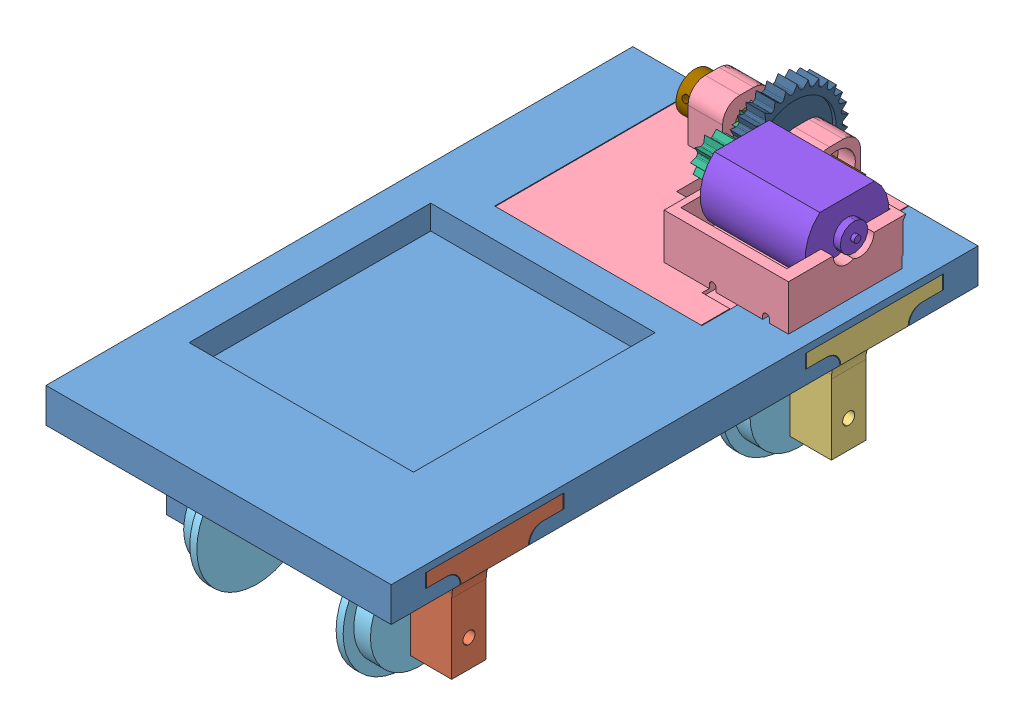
SolidWorks assembly Assem2.SLDASM, configuration 1:48 (file format 10000). Lengths in mm.
Overall size (100.76 89.97 188.72).
16 component instances, 10 part files, 34 mates.
Components (placement in the parent):
- Body-v2-1: Body-v2.SLDPRT [Default] at (-15.9866 -10.977 75.2615) size (100 40 170)
- Wheel leg-1: Wheel leg.SLDPRT [Default] at (7.0634 -20.977 130.2615) size (28.46 38 39.5)
- Wheel leg back-1: Wheel leg back.SLDPRT [Default] at (7.0634 -20.977 20.2615) size (28.46 38 39.5)
- platform-1: platform.SLDPRT [기본] at (-15.9866 -20.977 50.2615) x (-1 0 0) z (0 0 -1) size (84.5 40 60)
- Wheels-1: Wheels.SLDPRT [Default] at (5.4309 -42.977 20.2615) x (0 0 -1) z (1 0 0) size (34.75 34.75 71.1)
- Wheels-2: Wheels.SLDPRT [Default] at (5.4309 -42.977 130.2615) x (0 0 -1) z (1 0 0) size (34.75 34.75 71.1)
- 10-T-Gear-1: 10-T-Gear.SLDPRT [Default] at (-29.9291 -28.367 -0.0285) x (0 0.227115 0.973868) z (0 0.973868 -0.227115) size (10.42 5.5 10.96)
- 10-T-Gear-2: 10-T-Gear.SLDPRT [Default] at (-22.4291 -3.367 -0.0285) x (0 0.934537 -0.355867) z (0 -0.355867 -0.934537) size (10.42 5.5 10.96)
- 10-T-Gear-3: 10-T-Gear.SLDPRT [Default] at (-9.4291 2.173 19.1889) x (0 -0.761659 0.647978) z (0 -0.647978 -0.761659) size (10.42 5.5 10.96)
- 40-T-Gear-1: 40-T-Gear.SLDPRT [Default] at (-16.9291 -28.367 -0.0285) x (0 0.500653 0.865648) z (0 -0.865648 0.500653) size (41.62 5.5 41.62)
- 40-T-Gear-2: 40-T-Gear.SLDPRT [Default] at (-14.9291 -3.367 -0.0285) x (0 -0.105905 -0.994376) z (0 -0.994376 0.105905) size (41.62 5.5 41.62) (suppressed, hidden)
- 40-T-Gear-3: 40-T-Gear.SLDPRT [Default] at (-24.4291 -42.977 20.2615) x (0 -0.657601 0.753367) z (0 -0.753367 -0.657601) size (41.62 5.5 41.62)
- Motor-1: Motor.SLDPRT [Default] at (-5.4791 2.173 19.1889) x (0 0 -1) z (1 0 0) size (24.2 18.3 42)
- gear shaft-1: gear shaft.SLDPRT [Default] at (-28.2866 -5.9062 -1.2745) x (0 0.946298 -0.323295) z (1 0 0) size (11 11 47)
- gear shaft-2: gear shaft.SLDPRT [Default] at (-36.9266 -31.0853 0.7532) x (0 0.484137 -0.874992) z (1 0 0) size (11 11 47)
- 30-T-Gear-1: 30-T-Gear.SLDPRT [Default] at (-14.9291 -3.367 -0.0285) x (0 -0.451043 -0.892502) z (0 -0.892502 0.451043)
Mates (geometry in assembly coordinates):
- Coincident2: coincident anti-aligned: plane of Body-v2-1 through (7.0634 -12.977 110.2615) normal (0 -1 0); plane of Wheel leg-1 through (34.0134 -12.977 150.0115) normal (0 1 0)
- Coincident3: coincident anti-aligned: plane of Body-v2-1 through (7.0634 -10.977 75.2615) normal (1 0 0); plane of Wheel leg-1 through (7.0634 -20.977 130.2615) normal (-1 0 0)
- Width1: width anti-aligned: plane of Body-v2-1 through (7.0634 -12.977 150.2615) normal (0 0 -1); plane of Body-v2-1 through (7.0634 -16.977 110.2615) normal (0 0 1); plane of Wheel leg-1 through (34.0134 -16.977 150.0115) normal (0 0 1); plane of Wheel leg-1 through (34.0134 -12.977 110.5115) normal (0 0 -1)
- Coincident4: coincident anti-aligned: plane of Body-v2-1 through (7.0634 -12.977 40.2615) normal (0 -1 0); plane of Wheel leg back-1 through (34.0134 -12.977 40.0115) normal (0 1 0)
- Coincident5: coincident aligned: plane of Body-v2-1 through (34.0134 -20.977 160.2615) normal (1 0 0); plane of Wheel leg back-1 through (34.0134 -20.977 20.2615) normal (1 0 0)
- Width2: width anti-aligned: plane of Body-v2-1 through (7.0634 -12.977 0.2615) normal (0 0 1); plane of Body-v2-1 through (7.0634 -16.977 40.2615) normal (0 0 -1); plane of Wheel leg back-1 through (34.0134 -12.977 0.5115) normal (0 0 -1); plane of Wheel leg back-1 through (34.0134 -16.977 40.0115) normal (0 0 1)
- Coincident6: coincident anti-aligned: plane of Body-v2-1 through (-15.9866 -10.977 50.2615) normal (0 0 -1); plane of platform-1 through (-15.9866 -20.977 50.2615) normal (0 0 1)
- Coincident7: coincident aligned: plane of Body-v2-1 through (-15.9866 -10.977 75.2615) normal (0 1 0); plane of platform-1 through (-15.9866 -10.977 -9.7385) normal (0 1 0)
- Width3: width anti-aligned: plane of Body-v2-1 through (-55.9866 -10.977 50.2615) normal (1 0 0); plane of Body-v2-1 through (24.0134 -10.977 50.2615) normal (-1 0 0); plane of platform-1 through (-55.7866 -20.977 -9.7385) normal (-1 0 0); plane of platform-1 through (23.8134 -20.977 -9.7385) normal (1 0 0)
- Concentric1: concentric aligned: cylinder of Body-v2-1 through (-65.9866 -42.977 20.2615) axis (1 0 0) radius 1.75; cylinder of Wheels-1 through (-34.9291 -42.977 20.2615) axis (1 0 0) radius 2.74
- Width4: width anti-aligned: plane of Wheel leg back-1 through (14.5384 -50.977 25.2615) normal (-1 0 0); plane of Body-v2-1 through (-44.0366 -50.977 15.2615) normal (1 0 0); plane of Wheels-1 through (12.3009 -42.977 20.2615) normal (1 0 0); plane of Wheels-1 through (-41.7991 -42.977 20.2615) normal (-1 0 0)
- Concentric2: concentric aligned: cylinder of Body-v2-1 through (-65.9866 -42.977 130.2615) axis (1 0 0) radius 1.75; cylinder of Wheels-2 through (-34.9291 -42.977 130.2615) axis (1 0 0) radius 2.74
- Width5: width anti-aligned: plane of Body-v2-1 through (-44.0366 -50.977 135.2615) normal (1 0 0); plane of Wheel leg-1 through (14.5384 -50.977 135.2615) normal (-1 0 0); plane of Wheels-2 through (-41.7991 -42.977 130.2615) normal (-1 0 0); plane of Wheels-2 through (12.3009 -42.977 130.2615) normal (1 0 0)
- Concentric3: concentric anti-aligned: cylinder of Wheels-1 through (-34.9291 -42.977 20.2615) axis (1 0 0) radius 2.74; cylinder of 40-T-Gear-3 through (-24.4291 -42.977 20.2615) axis (-1 0 0) radius 2.75
- Coincident8: coincident aligned: plane of 10-T-Gear-1 through (-24.4291 -32.0689 1.9019) normal (1 0 0); plane of 40-T-Gear-3 through (-24.4291 -42.977 20.2615) normal (1 0 0)
- Distance1: distance = 5 mm anti-aligned: plane of 40-T-Gear-3 through (-29.9291 -42.977 20.2615) normal (-1 0 0); plane of Wheels-1 through (-34.9291 -42.977 20.2615) normal (1 0 0)
- Concentric6: concentric anti-aligned: cylinder of 10-T-Gear-1 through (-29.9291 -28.367 -0.0285) axis (1 0 0) radius 1.5; cylinder of 40-T-Gear-1 through (-16.9291 -28.367 -0.0285) axis (-1 0 0) radius 2.75
- Distance2: distance = 2 mm anti-aligned: plane of 40-T-Gear-1 through (-22.4291 -28.367 -0.0285) normal (-1 0 0); plane of 10-T-Gear-1 through (-24.4291 -32.0689 1.9019) normal (1 0 0)
- Coincident12: coincident aligned: plane of 10-T-Gear-2 through (-22.4291 -0.9569 3.3806) normal (-1 0 0); plane of 40-T-Gear-1 through (-22.4291 -28.367 -0.0285) normal (-1 0 0)
- Concentric13: concentric aligned: cylinder of 10-T-Gear-2 through (-22.4291 -3.367 -0.0285) axis (1 0 0) radius 1.5; cylinder of 40-T-Gear-2 through (-14.9291 -3.367 -0.0285) axis (1 0 0) radius 2.75
- Distance4: distance = 2 mm anti-aligned: plane of 40-T-Gear-2 through (-14.9291 -3.367 -0.0285) normal (-1 0 0); plane of 10-T-Gear-2 through (-16.9291 -0.9569 3.3806) normal (1 0 0)
- Coincident15: coincident aligned: plane of 10-T-Gear-3 through (-9.4291 4.0017 28.1031) normal (1 0 0); plane of 40-T-Gear-2 through (-9.4291 -3.367 -0.0285) normal (1 0 0)
- Tangent8: tangent: circle of 10-T-Gear-3; circle of 40-T-Gear-2
- Concentric16: concentric anti-aligned: cylinder of 10-T-Gear-3 through (-9.4291 2.173 19.1889) axis (-1 0 0) radius 1.5; cylinder of Motor-1 through (-13.9291 2.173 19.1889) axis (1 0 0) radius 1
- Coincident17: coincident aligned: plane of 10-T-Gear-3 through (-13.9291 2.173 19.1889) normal (-1 0 0); plane of Motor-1 through (-13.9291 2.173 19.1889) normal (-1 0 0)
- Distance5: distance = 4 mm anti-aligned: plane of platform-1 through (-15.9866 -10.977 -9.7385) normal (0 1 0); plane of Motor-1 through (25.0209 -6.977 27.1064) normal (0 -1 0)
- Concentric17: concentric aligned: cylinder of platform-1 through (-33.2866 -3.367 -0.0285) axis (1 0 0) radius 3.5; cylinder of 10-T-Gear-2 through (-22.4291 -3.367 -0.0285) axis (1 0 0) radius 1.5
- Concentric19: concentric aligned: cylinder of platform-1 through (-41.9266 -28.367 -0.0285) axis (1 0 0) radius 3.5; cylinder of 10-T-Gear-1 through (-29.9291 -28.367 -0.0285) axis (1 0 0) radius 1.5
- Concentric20: concentric anti-aligned: cylinder of platform-1 through (-28.2866 -3.367 -0.0285) axis (-1 0 0) radius 5.5; cylinder of gear shaft-1 through (-38.2866 -3.367 -0.0285) axis (1 0 0) radius 5.5
- Coincident23: coincident anti-aligned: plane of platform-1 through (-28.2866 -3.367 -0.0285) normal (-1 0 0); plane of gear shaft-1 through (-28.2866 -3.367 -0.0285) normal (1 0 0)
- Coincident24: coincident anti-aligned: plane of platform-1 through (-36.9266 -28.367 -0.0285) normal (-1 0 0); plane of gear shaft-2 through (-36.9266 -28.367 -0.0285) normal (1 0 0)
- Concentric21: concentric anti-aligned: cylinder of platform-1 through (-36.9266 -28.367 -0.0285) axis (-1 0 0) radius 5.5; cylinder of gear shaft-2 through (-46.9266 -28.367 -0.0285) axis (1 0 0) radius 5.5
- Tangent9: tangent: circle of 10-T-Gear-3; circle of 30-T-Gear-1
- Concentric23: concentric anti-aligned: cylinder of platform-1 through (2.7134 -3.367 -0.0285) axis (-1 0 0) radius 3.5; cylinder of 30-T-Gear-1 through (-14.9291 -3.367 -0.0285) axis (1 0 0) radius 2.75
